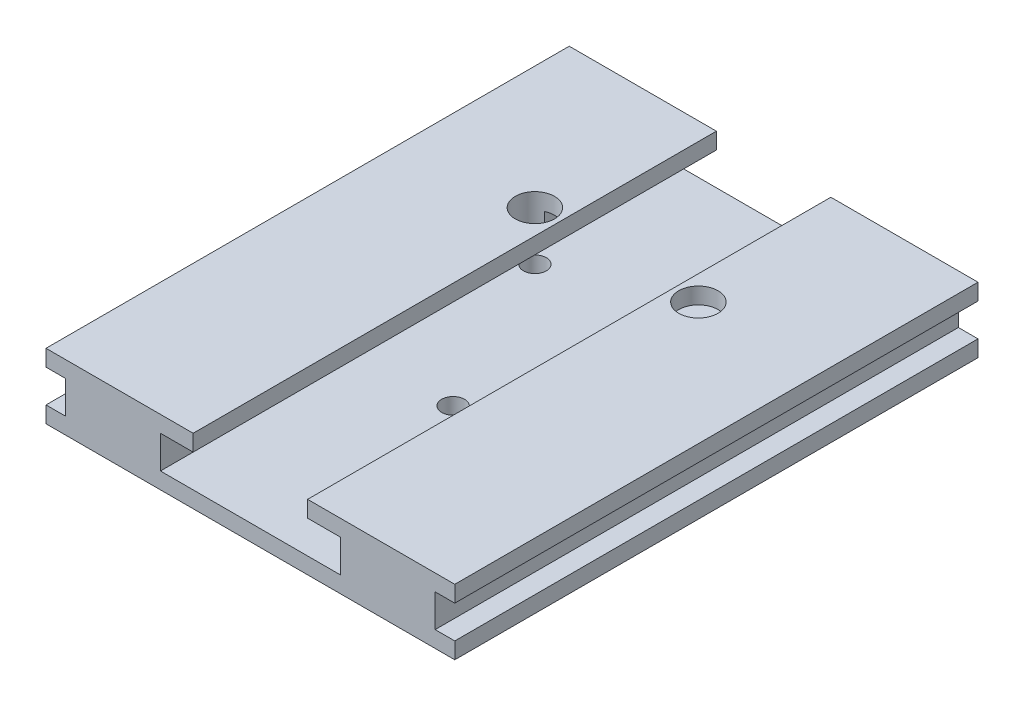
from build123d import *

# Parameters (mm, degrees)
ESQUISSE1_W             = 125
ESQUISSE1_H             = 20
EXTRUSION1_DEPTH        = 360
ESQUISSE2_W             = 6
ESQUISSE2_H             = 10
ENL_V_MAT_EXTRU_1_DEPTH = 375.594273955
ESQUISSE4_R             = 3.5
ENL_V_MAT_EXTRU_3_DEPTH = 370.063749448
ESQUISSE5_W             = 140.439567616
ESQUISSE5_H             = 200
ENL_V_MAT_EXTRU_4_DEPTH = 370.063749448
ESQUISSE6_R             = 6
ENL_V_MAT_EXTRU_5_DEPTH = 15


with BuildPart() as part:
    # Esquisse1 → Extrusion1 (new body)
    with BuildSketch(Plane.XY):
        with Locations((16.29118705, -57.177517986)):
            Rectangle(ESQUISSE1_W, ESQUISSE1_H)
    extrude(amount=EXTRUSION1_DEPTH)

    # Esquisse2 → Enl_v. mat.-Extru.1 (cut, through all)
    with BuildSketch(Plane.XY.offset(360)):
        with Locations((75.79118705, -57.177517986)):
            Rectangle(ESQUISSE2_W, ESQUISSE2_H)
        with Locations((-43.20881295, -57.177517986)):
            Rectangle(ESQUISSE2_W, ESQUISSE2_H)
        Polygon((33.79118705, -52.177517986), (43.79118705, -52.177517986), (43.79118705, -62.177517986), (-11.20881295, -62.177517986), (-11.20881295, -52.177517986), (-1.20881295, -52.177517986), (-1.20881295, -47.177517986), (33.79118705, -47.177517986), align=None)
    extrude(amount=-ENL_V_MAT_EXTRU_1_DEPTH, mode=Mode.SUBTRACT)

    # Esquisse4 → Enl_v. mat.-Extru.3 (cut, through all)
    with BuildSketch(Plane.XZ.offset(67.177517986)):
        with Locations(Location((41.29118705, 248, 0), (0, 0, 270))):
            Circle(ESQUISSE4_R)
        with Locations(Location((-8.70881295, 248, 0), (0, 0, 270))):
            Circle(ESQUISSE4_R)
        with Locations(Location((16.29118705, 298, 0), (0, 0, 270))):
            Circle(ESQUISSE4_R)
    extrude(amount=-ENL_V_MAT_EXTRU_3_DEPTH, mode=Mode.SUBTRACT)

    # Esquisse5 → Enl_v. mat.-Extru.4 (cut, through all)
    with BuildSketch(Plane(origin=(0, -47.177517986, 0), x_dir=(1, 0, 0), z_dir=(0, 1, 0))):
        with Locations((24.010970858, -100)):
            Rectangle(ESQUISSE5_W, ESQUISSE5_H)
    extrude(amount=-ENL_V_MAT_EXTRU_4_DEPTH, mode=Mode.SUBTRACT)

    # Esquisse6 → Enl_v. mat.-Extru.5 (cut)
    with BuildSketch(Plane(origin=(0, -47.177517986, 0), x_dir=(1, 0, 0), z_dir=(0, 1, 0))):
        with Locations(Location((41.29118705, -248, 0), (0, 0, 270))):
            Circle(ESQUISSE6_R)
        with Locations(Location((-8.70881295, -248, 0), (0, 0, 270))):
            Circle(ESQUISSE6_R)
    extrude(amount=-ENL_V_MAT_EXTRU_5_DEPTH, mode=Mode.SUBTRACT)


solid = part.part
